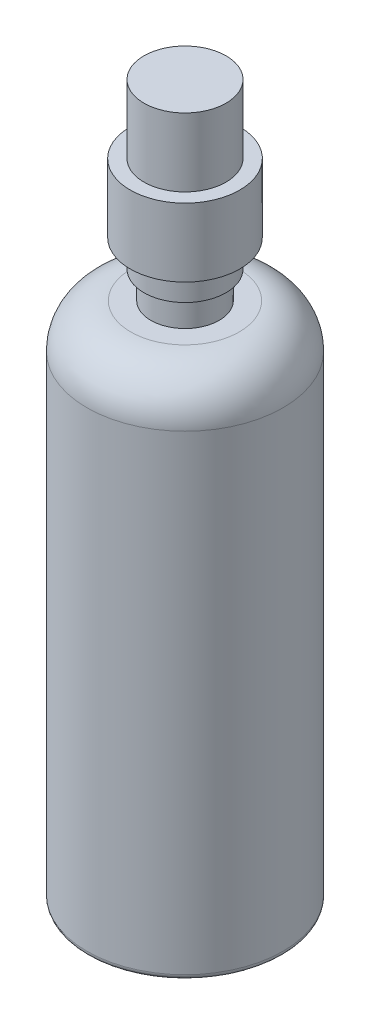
from build123d import *

# Parameters (mm, degrees)
FILLET1_R = 20.32
FILLET2_R = 2.54


with BuildPart() as part:
    # Sketch1 → Revolve1 (revolve)
    with BuildSketch(Plane.XY, mode=Mode.PRIVATE) as revolve1_sk:
        Polygon((0, 0), (-45.5, 0), (-45.5, 241.3), (-15.875, 241.3), (-15.875, 254), (-19.05, 254), (-19.05, 266.7), (-25.4, 266.7), (-25.4, 298.45), (-19.05, 298.45), (-19.05, 330.2), (0, 330.2), align=None)
    revolve(revolve1_sk.sketch.rotate(Axis((0, -4.563417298, 0), (0, 1, 0)), 270), axis=Axis((0, -4.563417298, 0), (0, 1, 0)))

    # Fillet1
    fillet1_edges = [part.edges().sort_by_distance(p)[0] for p in [
        (0, 241.3, 45.5),
    ]]
    fillet(fillet1_edges, radius=FILLET1_R)

    # Fillet2
    fillet2_edges = [part.edges().sort_by_distance(p)[0] for p in [
        (0, 0, 45.5),
    ]]
    fillet(fillet2_edges, radius=FILLET2_R)


solid = part.part
